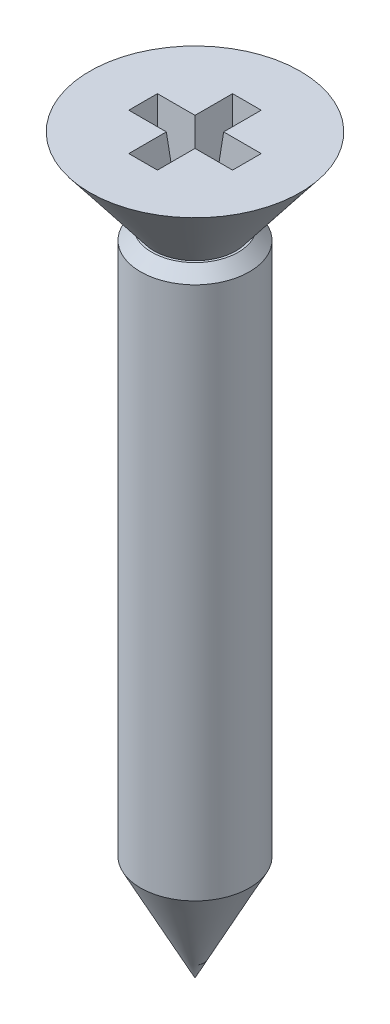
from build123d import *

# Parameters (mm, degrees)
CHANFREIN2_SIZE         = 0.3
ENL_V_MAT_EXTRU_1_DEPTH = 1.5
D_POUILLE1_ANGLE        = 5


with BuildPart() as part:
    # Esquisse1 → R_volution1 (revolve)
    with BuildSketch(Plane.XY, mode=Mode.PRIVATE) as r_volution1_sk:
        Polygon((0, -3.448239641), (2.8, -3.448239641), (1.09, -5.648239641), (1.45, -5.648239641), (1.45, -20.148239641), (0, -22.948239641), align=None)
    revolve(r_volution1_sk.sketch.rotate(Axis((0, 0, 0), (0, -1, 0)), 90), axis=Axis((0, 0, 0), (0, -1, 0)))

    # Chanfrein2
    chanfrein2_edges = [part.edges().sort_by_distance(p)[0] for p in [
        (0, -5.648239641, -1.45),
    ]]
    chamfer(chanfrein2_edges, length=CHANFREIN2_SIZE)

    # Esquisse2 → Enl_v. mat.-Extru.1 (cut)
    with BuildSketch(Plane(origin=(0, -3.448239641, 0), x_dir=(-1, 0, 0), z_dir=(0, 1, 0))):
        Polygon((0.25, -1.25), (-0.25, -1.25), (-0.25, -0.25), (-1.25, -0.25), (-1.25, 0.25), (-0.25, 0.25), (-0.25, 1.25), (0.25, 1.25), (0.25, 0.25), (1.25, 0.25), (1.25, -0.25), (0.25, -0.25), align=None)
    extrude(amount=-ENL_V_MAT_EXTRU_1_DEPTH, mode=Mode.SUBTRACT)

    # D_pouille1
    d_pouille1_faces = [part.faces().sort_by_distance(p)[0] for p in [
        (0.25, -4.198239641, 0.75),
        (1.25, -4.198239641, 0),
        (0.25, -4.198239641, -0.75),
        (-0.25, -4.198239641, 0.75),
        (-0.25, -4.198239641, -0.75),
        (-1.25, -4.198239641, 0),
        (0, -4.198239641, 1.25),
        (-0.75, -4.198239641, 0.25),
        (0.75, -4.198239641, 0.25),
        (0, -4.198239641, -1.25),
        (0.75, -4.198239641, -0.25),
        (-0.75, -4.198239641, -0.25),
    ]]
    draft(d_pouille1_faces, Plane(origin=(-0.25, -4.948239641, 0.25), x_dir=(0, 0, 1), z_dir=(0, 1, 0)), D_POUILLE1_ANGLE)


solid = part.part
